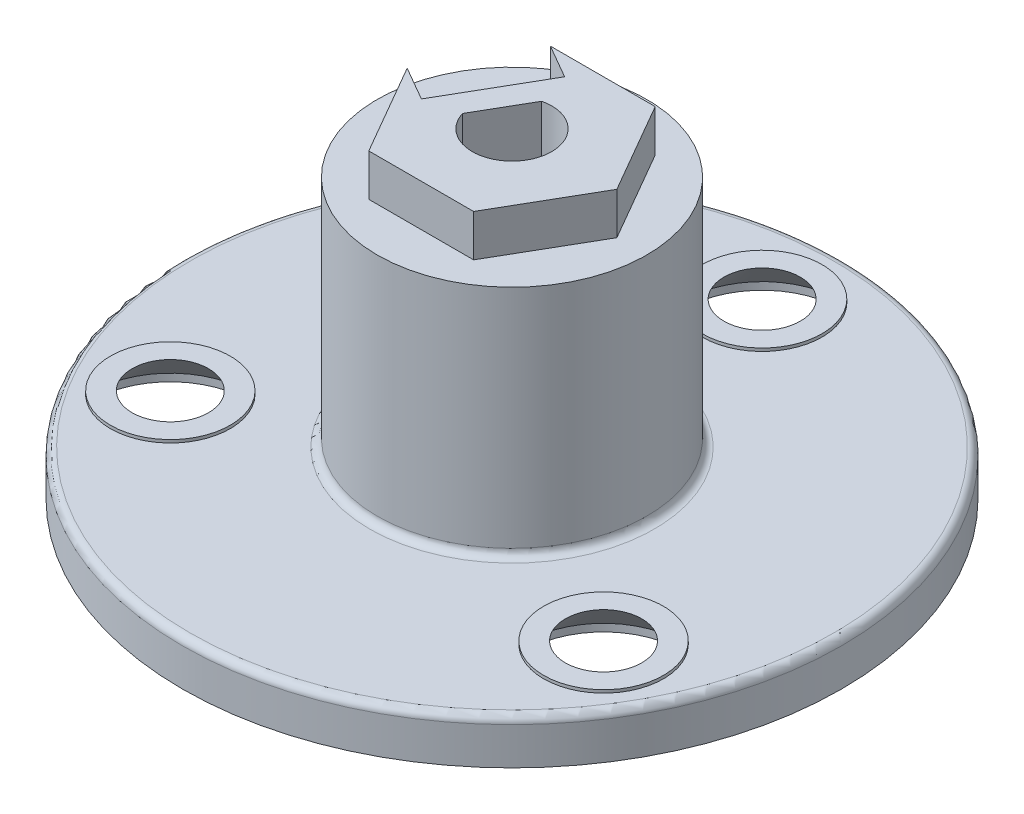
ISO-10303-21;
HEADER;
FILE_DESCRIPTION(('STEP AP214'),'2;1');
FILE_NAME('part.step','',(''),(''),'','','');
FILE_SCHEMA(('AUTOMOTIVE_DESIGN { 1 0 10303 214 1 1 1 1 }'));
ENDSEC;
DATA;
#1=APPLICATION_CONTEXT('core data for automotive mechanical design processes');
#2=APPLICATION_PROTOCOL_DEFINITION('international standard','automotive_design',2000,#1);
#3=PRODUCT_CONTEXT('',#1,'mechanical');
#4=PRODUCT('Part','Part','',(#3));
#5=PRODUCT_RELATED_PRODUCT_CATEGORY('part','',(#4));
#6=PRODUCT_DEFINITION_FORMATION('','',#4);
#7=PRODUCT_DEFINITION_CONTEXT('part definition',#1,'design');
#8=PRODUCT_DEFINITION('design','',#6,#7);
#9=PRODUCT_DEFINITION_SHAPE('','',#8);
#10=(LENGTH_UNIT() NAMED_UNIT(*) SI_UNIT(.MILLI.,.METRE.));
#11=(NAMED_UNIT(*) PLANE_ANGLE_UNIT() SI_UNIT($,.RADIAN.));
#12=(NAMED_UNIT(*) SI_UNIT($,.STERADIAN.) SOLID_ANGLE_UNIT());
#13=UNCERTAINTY_MEASURE_WITH_UNIT(LENGTH_MEASURE(1.E-05),#10,'distance_accuracy_value','');
#14=(GEOMETRIC_REPRESENTATION_CONTEXT(3) GLOBAL_UNCERTAINTY_ASSIGNED_CONTEXT((#13)) GLOBAL_UNIT_ASSIGNED_CONTEXT((#10,
#11,#12)) REPRESENTATION_CONTEXT('',''));
#15=CARTESIAN_POINT('',(0.,0.,0.));
#16=DIRECTION('',(0.,0.,1.));
#17=DIRECTION('',(1.,0.,0.));
#18=AXIS2_PLACEMENT_3D('',#15,#16,#17);
#19=CARTESIAN_POINT('',(0.,3.,0.));
#20=DIRECTION('',(0.,1.,0.));
#21=DIRECTION('',(0.,0.,1.));
#22=AXIS2_PLACEMENT_3D('',#19,#20,#21);
#23=PLANE('',#22);
#24=CARTESIAN_POINT('',(0.,3.,0.));
#25=DIRECTION('',(0.,1.,0.));
#26=DIRECTION('',(0.,0.,1.));
#27=AXIS2_PLACEMENT_3D('',#24,#25,#26);
#28=CIRCLE('',#27,9.5);
#29=CARTESIAN_POINT('',(0.,3.,9.5));
#30=VERTEX_POINT('',#29);
#31=EDGE_CURVE('E48',#30,#30,#28,.F.);
#32=ORIENTED_EDGE('',*,*,#31,.T.);
#33=EDGE_LOOP('',(#32));
#34=FACE_BOUND('',#33,.T.);
#35=CARTESIAN_POINT('',(0.,3.,0.));
#36=DIRECTION('',(0.,1.,0.));
#37=DIRECTION('',(0.,0.,1.));
#38=AXIS2_PLACEMENT_3D('',#35,#36,#37);
#39=CIRCLE('',#38,21.5);
#40=CARTESIAN_POINT('',(0.,3.,21.5));
#41=VERTEX_POINT('',#40);
#42=EDGE_CURVE('E318',#41,#41,#39,.T.);
#43=ORIENTED_EDGE('',*,*,#42,.T.);
#44=EDGE_LOOP('',(#43));
#45=FACE_BOUND('',#44,.T.);
#46=CARTESIAN_POINT('',(-14.4626242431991,3.,8.34999999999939));
#47=DIRECTION('',(0.,1.,0.));
#48=DIRECTION('',(0.,0.,1.));
#49=AXIS2_PLACEMENT_3D('',#46,#47,#48);
#50=CIRCLE('',#49,4.);
#51=CARTESIAN_POINT('',(-14.4626242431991,3.,12.3499999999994));
#52=VERTEX_POINT('',#51);
#53=EDGE_CURVE('E223',#52,#52,#50,.T.);
#54=ORIENTED_EDGE('',*,*,#53,.F.);
#55=EDGE_LOOP('',(#54));
#56=FACE_BOUND('',#55,.T.);
#57=CARTESIAN_POINT('',(1.0696165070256E-12,3.,-16.6999999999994));
#58=DIRECTION('',(0.,1.,0.));
#59=DIRECTION('',(0.,0.,1.));
#60=AXIS2_PLACEMENT_3D('',#57,#58,#59);
#61=CIRCLE('',#60,4.);
#62=CARTESIAN_POINT('',(1.0696165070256E-12,3.,-12.6999999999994));
#63=VERTEX_POINT('',#62);
#64=EDGE_CURVE('E243',#63,#63,#61,.T.);
#65=ORIENTED_EDGE('',*,*,#64,.F.);
#66=EDGE_LOOP('',(#65));
#67=FACE_BOUND('',#66,.T.);
#68=CARTESIAN_POINT('',(14.4626242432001,3.,8.35));
#69=DIRECTION('',(0.,1.,0.));
#70=DIRECTION('',(0.,0.,1.));
#71=AXIS2_PLACEMENT_3D('',#68,#69,#70);
#72=CIRCLE('',#71,4.);
#73=CARTESIAN_POINT('',(14.4626242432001,3.,12.35));
#74=VERTEX_POINT('',#73);
#75=EDGE_CURVE('E237',#74,#74,#72,.T.);
#76=ORIENTED_EDGE('',*,*,#75,.F.);
#77=EDGE_LOOP('',(#76));
#78=FACE_BOUND('',#77,.T.);
#79=ADVANCED_FACE('F39',(#34,#45,#56,#67,#78),#23,.T.);
#80=CARTESIAN_POINT('',(0.,0.,0.));
#81=DIRECTION('',(0.,1.,0.));
#82=DIRECTION('',(0.,0.,1.));
#83=AXIS2_PLACEMENT_3D('',#80,#81,#82);
#84=PLANE('',#83);
#85=CARTESIAN_POINT('',(14.4626242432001,0.,8.35));
#86=DIRECTION('',(0.,-1.,0.));
#87=DIRECTION('',(0.,0.,-1.));
#88=AXIS2_PLACEMENT_3D('',#85,#86,#87);
#89=CIRCLE('',#88,5.25);
#90=CARTESIAN_POINT('',(14.4626242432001,0.,3.1));
#91=VERTEX_POINT('',#90);
#92=EDGE_CURVE('E1025',#91,#91,#89,.T.);
#93=ORIENTED_EDGE('',*,*,#92,.F.);
#94=EDGE_LOOP('',(#93));
#95=FACE_BOUND('',#94,.T.);
#96=CARTESIAN_POINT('',(-14.4626242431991,0.,8.34999999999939));
#97=DIRECTION('',(0.,-1.,0.));
#98=DIRECTION('',(0.,0.,-1.));
#99=AXIS2_PLACEMENT_3D('',#96,#97,#98);
#100=CIRCLE('',#99,5.25);
#101=CARTESIAN_POINT('',(-14.4626242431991,0.,3.09999999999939));
#102=VERTEX_POINT('',#101);
#103=EDGE_CURVE('E313',#102,#102,#100,.T.);
#104=ORIENTED_EDGE('',*,*,#103,.F.);
#105=EDGE_LOOP('',(#104));
#106=FACE_BOUND('',#105,.T.);
#107=CARTESIAN_POINT('',(1.0696165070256E-12,0.,-16.6999999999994));
#108=DIRECTION('',(0.,-1.,0.));
#109=DIRECTION('',(0.,0.,-1.));
#110=AXIS2_PLACEMENT_3D('',#107,#108,#109);
#111=CIRCLE('',#110,5.25);
#112=CARTESIAN_POINT('',(1.0696165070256E-12,0.,-21.9499999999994));
#113=VERTEX_POINT('',#112);
#114=EDGE_CURVE('E307',#113,#113,#111,.T.);
#115=ORIENTED_EDGE('',*,*,#114,.F.);
#116=EDGE_LOOP('',(#115));
#117=FACE_BOUND('',#116,.T.);
#118=CARTESIAN_POINT('',(0.,0.,0.));
#119=DIRECTION('',(0.,1.,0.));
#120=DIRECTION('',(0.,0.,1.));
#121=AXIS2_PLACEMENT_3D('',#118,#119,#120);
#122=CIRCLE('',#121,22.);
#123=CARTESIAN_POINT('',(0.,0.,22.));
#124=VERTEX_POINT('',#123);
#125=EDGE_CURVE('E270',#124,#124,#122,.T.);
#126=ORIENTED_EDGE('',*,*,#125,.F.);
#127=EDGE_LOOP('',(#126));
#128=FACE_BOUND('',#127,.T.);
#129=CARTESIAN_POINT('',(0.,0.,0.));
#130=DIRECTION('',(0.,1.,0.));
#131=DIRECTION('',(0.,0.,1.));
#132=AXIS2_PLACEMENT_3D('',#129,#130,#131);
#133=CIRCLE('',#132,2.65);
#134=CARTESIAN_POINT('',(-2.53623385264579,0.,0.768126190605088));
#135=VERTEX_POINT('',#134);
#136=CARTESIAN_POINT('',(-0.602900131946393,0.,-2.58050604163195));
#137=VERTEX_POINT('',#136);
#138=EDGE_CURVE('E251',#135,#137,#133,.T.);
#139=ORIENTED_EDGE('',*,*,#138,.T.);
#140=DIRECTION('',(-0.500000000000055,0.,0.866025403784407));
#141=VECTOR('',#140,1.);
#142=CARTESIAN_POINT('',(-1.56956699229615,0.,-0.906189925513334));
#143=LINE('',#142,#141);
#144=EDGE_CURVE('E258',#137,#135,#143,.T.);
#145=ORIENTED_EDGE('',*,*,#144,.T.);
#146=EDGE_LOOP('',(#139,#145));
#147=FACE_BOUND('',#146,.T.);
#148=ADVANCED_FACE('F570',(#95,#106,#117,#128,#147),#84,.F.);
#149=CARTESIAN_POINT('',(0.,3.,0.));
#150=DIRECTION('',(0.,-1.,0.));
#151=DIRECTION('',(0.,0.,-1.));
#152=AXIS2_PLACEMENT_3D('',#149,#150,#151);
#153=CYLINDRICAL_SURFACE('',#152,22.);
#154=CARTESIAN_POINT('',(0.,2.5,0.));
#155=DIRECTION('',(0.,1.,0.));
#156=DIRECTION('',(0.,0.,1.));
#157=AXIS2_PLACEMENT_3D('',#154,#155,#156);
#158=CIRCLE('',#157,22.);
#159=CARTESIAN_POINT('',(0.,2.5,22.));
#160=VERTEX_POINT('',#159);
#161=EDGE_CURVE('E11',#160,#160,#158,.F.);
#162=ORIENTED_EDGE('',*,*,#161,.T.);
#163=EDGE_LOOP('',(#162));
#164=FACE_BOUND('',#163,.T.);
#165=ORIENTED_EDGE('',*,*,#125,.T.);
#166=EDGE_LOOP('',(#165));
#167=FACE_BOUND('',#166,.T.);
#168=ADVANCED_FACE('F577',(#164,#167),#153,.T.);
#169=CARTESIAN_POINT('',(0.,3.,0.));
#170=DIRECTION('',(0.,-1.,0.));
#171=DIRECTION('',(0.,0.,-1.));
#172=AXIS2_PLACEMENT_3D('',#169,#170,#171);
#173=CYLINDRICAL_SURFACE('',#172,2.65);
#174=ORIENTED_EDGE('',*,*,#138,.F.);
#175=DIRECTION('',(0.,-1.,0.));
#176=VECTOR('',#175,1.);
#177=CARTESIAN_POINT('',(-2.53623385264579,3.,0.768126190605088));
#178=LINE('',#177,#176);
#179=CARTESIAN_POINT('',(-2.53623385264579,21.4,0.768126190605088));
#180=VERTEX_POINT('',#179);
#181=EDGE_CURVE('E262',#180,#135,#178,.T.);
#182=ORIENTED_EDGE('',*,*,#181,.F.);
#183=CARTESIAN_POINT('',(0.,21.4,0.));
#184=DIRECTION('',(0.,1.,0.));
#185=DIRECTION('',(0.,0.,1.));
#186=AXIS2_PLACEMENT_3D('',#183,#184,#185);
#187=CIRCLE('',#186,2.65);
#188=CARTESIAN_POINT('',(-0.602900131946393,21.4,-2.58050604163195));
#189=VERTEX_POINT('',#188);
#190=EDGE_CURVE('E476',#180,#189,#187,.T.);
#191=ORIENTED_EDGE('',*,*,#190,.T.);
#192=DIRECTION('',(0.,-1.,0.));
#193=VECTOR('',#192,1.);
#194=CARTESIAN_POINT('',(-0.602900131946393,3.,-2.58050604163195));
#195=LINE('',#194,#193);
#196=EDGE_CURVE('E266',#189,#137,#195,.T.);
#197=ORIENTED_EDGE('',*,*,#196,.T.);
#198=EDGE_LOOP('',(#174,#182,#191,#197));
#199=FACE_BOUND('',#198,.T.);
#200=ADVANCED_FACE('F581',(#199),#173,.F.);
#201=CARTESIAN_POINT('',(-1.56956699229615,3.,-0.906189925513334));
#202=DIRECTION('',(0.866025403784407,0.,0.500000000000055));
#203=DIRECTION('',(0.500000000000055,0.,-0.866025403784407));
#204=AXIS2_PLACEMENT_3D('',#201,#202,#203);
#205=PLANE('',#204);
#206=DIRECTION('',(0.500000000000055,0.,-0.866025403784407));
#207=VECTOR('',#206,1.);
#208=CARTESIAN_POINT('',(-1.56956699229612,8.70330482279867,-0.90618992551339));
#209=LINE('',#208,#207);
#210=CARTESIAN_POINT('',(-1.95047907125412,8.70330482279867,-0.24643085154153));
#211=VERTEX_POINT('',#210);
#212=CARTESIAN_POINT('',(-1.18865491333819,8.70330482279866,-1.56594899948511));
#213=VERTEX_POINT('',#212);
#214=EDGE_CURVE('E442',#211,#213,#209,.T.);
#215=ORIENTED_EDGE('',*,*,#214,.F.);
#216=DIRECTION('',(0.250000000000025,-0.866025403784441,-0.433012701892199));
#217=VECTOR('',#216,1.);
#218=CARTESIAN_POINT('',(-0.620449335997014,4.09594666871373,-2.55010992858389));
#219=LINE('',#218,#217);
#220=CARTESIAN_POINT('',(-2.33139115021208,10.0228229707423,0.413328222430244));
#221=VERTEX_POINT('',#220);
#222=EDGE_CURVE('E389',#221,#211,#219,.T.);
#223=ORIENTED_EDGE('',*,*,#222,.F.);
#224=DIRECTION('',(-0.250000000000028,-0.866025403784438,0.433012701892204));
#225=VECTOR('',#224,1.);
#226=CARTESIAN_POINT('',(-3.6614208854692,5.41546481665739,2.71700729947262));
#227=LINE('',#226,#225);
#228=CARTESIAN_POINT('',(-1.95047907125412,11.3423411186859,-0.246430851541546));
#229=VERTEX_POINT('',#228);
#230=EDGE_CURVE('E399',#229,#221,#227,.T.);
#231=ORIENTED_EDGE('',*,*,#230,.F.);
#232=DIRECTION('',(-0.500000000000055,0.,0.866025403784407));
#233=VECTOR('',#232,1.);
#234=CARTESIAN_POINT('',(-1.56956699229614,11.3423411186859,-0.906189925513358));
#235=LINE('',#234,#233);
#236=CARTESIAN_POINT('',(-1.18865491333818,11.3423411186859,-1.56594899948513));
#237=VERTEX_POINT('',#236);
#238=EDGE_CURVE('E410',#237,#229,#235,.T.);
#239=ORIENTED_EDGE('',*,*,#238,.F.);
#240=DIRECTION('',(-0.250000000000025,0.866025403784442,0.433012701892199));
#241=VECTOR('',#240,1.);
#242=CARTESIAN_POINT('',(0.52228690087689,5.41546481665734,-4.52938715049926));
#243=LINE('',#242,#241);
#244=CARTESIAN_POINT('',(-0.807742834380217,10.0228229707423,-2.22570807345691));
#245=VERTEX_POINT('',#244);
#246=EDGE_CURVE('E421',#245,#237,#243,.T.);
#247=ORIENTED_EDGE('',*,*,#246,.F.);
#248=DIRECTION('',(0.250000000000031,0.866025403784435,-0.433012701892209));
#249=VECTOR('',#248,1.);
#250=CARTESIAN_POINT('',(-2.51868464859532,4.0959466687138,0.737730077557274));
#251=LINE('',#250,#249);
#252=EDGE_CURVE('E432',#213,#245,#251,.T.);
#253=ORIENTED_EDGE('',*,*,#252,.F.);
#254=EDGE_LOOP('',(#215,#223,#231,#239,#247,#253));
#255=FACE_BOUND('',#254,.T.);
#256=ORIENTED_EDGE('',*,*,#144,.F.);
#257=ORIENTED_EDGE('',*,*,#196,.F.);
#258=DIRECTION('',(-0.500000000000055,0.,0.866025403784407));
#259=VECTOR('',#258,1.);
#260=CARTESIAN_POINT('',(-2.53623385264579,21.4,0.768126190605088));
#261=LINE('',#260,#259);
#262=EDGE_CURVE('E488',#189,#180,#261,.T.);
#263=ORIENTED_EDGE('',*,*,#262,.T.);
#264=ORIENTED_EDGE('',*,*,#181,.T.);
#265=EDGE_LOOP('',(#256,#257,#263,#264));
#266=FACE_BOUND('',#265,.T.);
#267=ADVANCED_FACE('F589',(#255,#266),#205,.T.);
#268=CARTESIAN_POINT('',(1.0696165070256E-12,3.2,-16.6999999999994));
#269=DIRECTION('',(0.,1.,0.));
#270=DIRECTION('',(0.,0.,1.));
#271=AXIS2_PLACEMENT_3D('',#268,#269,#270);
#272=PLANE('',#271);
#273=CARTESIAN_POINT('',(1.0696165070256E-12,3.2,-16.6999999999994));
#274=DIRECTION('',(0.,1.,0.));
#275=DIRECTION('',(0.,0.,1.));
#276=AXIS2_PLACEMENT_3D('',#273,#274,#275);
#277=CIRCLE('',#276,2.55);
#278=CARTESIAN_POINT('',(1.0696165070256E-12,3.2,-14.1499999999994));
#279=VERTEX_POINT('',#278);
#280=EDGE_CURVE('E217',#279,#279,#277,.T.);
#281=ORIENTED_EDGE('',*,*,#280,.F.);
#282=EDGE_LOOP('',(#281));
#283=FACE_BOUND('',#282,.T.);
#284=CARTESIAN_POINT('',(1.0696165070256E-12,3.2,-16.6999999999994));
#285=DIRECTION('',(0.,1.,0.));
#286=DIRECTION('',(0.,0.,1.));
#287=AXIS2_PLACEMENT_3D('',#284,#285,#286);
#288=CIRCLE('',#287,4.);
#289=CARTESIAN_POINT('',(1.0696165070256E-12,3.2,-12.6999999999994));
#290=VERTEX_POINT('',#289);
#291=EDGE_CURVE('E247',#290,#290,#288,.T.);
#292=ORIENTED_EDGE('',*,*,#291,.T.);
#293=EDGE_LOOP('',(#292));
#294=FACE_BOUND('',#293,.T.);
#295=ADVANCED_FACE('F631',(#283,#294),#272,.T.);
#296=CARTESIAN_POINT('',(1.0696165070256E-12,3.2,-16.6999999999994));
#297=DIRECTION('',(0.,-1.,0.));
#298=DIRECTION('',(0.,0.,-1.));
#299=AXIS2_PLACEMENT_3D('',#296,#297,#298);
#300=CYLINDRICAL_SURFACE('',#299,4.);
#301=ORIENTED_EDGE('',*,*,#291,.F.);
#302=EDGE_LOOP('',(#301));
#303=FACE_BOUND('',#302,.T.);
#304=ORIENTED_EDGE('',*,*,#64,.T.);
#305=EDGE_LOOP('',(#304));
#306=FACE_BOUND('',#305,.T.);
#307=ADVANCED_FACE('F626',(#303,#306),#300,.T.);
#308=CARTESIAN_POINT('',(14.4626242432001,3.2,8.35));
#309=DIRECTION('',(0.,1.,0.));
#310=DIRECTION('',(0.,0.,1.));
#311=AXIS2_PLACEMENT_3D('',#308,#309,#310);
#312=PLANE('',#311);
#313=CARTESIAN_POINT('',(14.4626242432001,3.2,8.35));
#314=DIRECTION('',(0.,1.,0.));
#315=DIRECTION('',(0.,0.,1.));
#316=AXIS2_PLACEMENT_3D('',#313,#314,#315);
#317=CIRCLE('',#316,2.55);
#318=CARTESIAN_POINT('',(14.4626242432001,3.2,10.9));
#319=VERTEX_POINT('',#318);
#320=EDGE_CURVE('E309',#319,#319,#317,.T.);
#321=ORIENTED_EDGE('',*,*,#320,.F.);
#322=EDGE_LOOP('',(#321));
#323=FACE_BOUND('',#322,.T.);
#324=CARTESIAN_POINT('',(14.4626242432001,3.2,8.35));
#325=DIRECTION('',(0.,1.,0.));
#326=DIRECTION('',(0.,0.,1.));
#327=AXIS2_PLACEMENT_3D('',#324,#325,#326);
#328=CIRCLE('',#327,4.);
#329=CARTESIAN_POINT('',(14.4626242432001,3.2,12.35));
#330=VERTEX_POINT('',#329);
#331=EDGE_CURVE('E239',#330,#330,#328,.T.);
#332=ORIENTED_EDGE('',*,*,#331,.T.);
#333=EDGE_LOOP('',(#332));
#334=FACE_BOUND('',#333,.T.);
#335=ADVANCED_FACE('F623',(#323,#334),#312,.T.);
#336=CARTESIAN_POINT('',(14.4626242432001,3.2,8.35));
#337=DIRECTION('',(0.,-1.,0.));
#338=DIRECTION('',(0.,0.,-1.));
#339=AXIS2_PLACEMENT_3D('',#336,#337,#338);
#340=CYLINDRICAL_SURFACE('',#339,4.);
#341=ORIENTED_EDGE('',*,*,#331,.F.);
#342=EDGE_LOOP('',(#341));
#343=FACE_BOUND('',#342,.T.);
#344=ORIENTED_EDGE('',*,*,#75,.T.);
#345=EDGE_LOOP('',(#344));
#346=FACE_BOUND('',#345,.T.);
#347=ADVANCED_FACE('F619',(#343,#346),#340,.T.);
#348=CARTESIAN_POINT('',(-14.4626242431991,3.2,8.34999999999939));
#349=DIRECTION('',(0.,1.,0.));
#350=DIRECTION('',(0.,0.,1.));
#351=AXIS2_PLACEMENT_3D('',#348,#349,#350);
#352=PLANE('',#351);
#353=CARTESIAN_POINT('',(-14.4626242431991,3.2,8.34999999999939));
#354=DIRECTION('',(0.,1.,0.));
#355=DIRECTION('',(0.,0.,1.));
#356=AXIS2_PLACEMENT_3D('',#353,#354,#355);
#357=CIRCLE('',#356,2.55);
#358=CARTESIAN_POINT('',(-14.4626242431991,3.2,10.8999999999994));
#359=VERTEX_POINT('',#358);
#360=EDGE_CURVE('E303',#359,#359,#357,.T.);
#361=ORIENTED_EDGE('',*,*,#360,.F.);
#362=EDGE_LOOP('',(#361));
#363=FACE_BOUND('',#362,.T.);
#364=CARTESIAN_POINT('',(-14.4626242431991,3.2,8.34999999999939));
#365=DIRECTION('',(0.,1.,0.));
#366=DIRECTION('',(0.,0.,1.));
#367=AXIS2_PLACEMENT_3D('',#364,#365,#366);
#368=CIRCLE('',#367,4.);
#369=CARTESIAN_POINT('',(-14.4626242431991,3.2,12.3499999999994));
#370=VERTEX_POINT('',#369);
#371=EDGE_CURVE('E229',#370,#370,#368,.T.);
#372=ORIENTED_EDGE('',*,*,#371,.T.);
#373=EDGE_LOOP('',(#372));
#374=FACE_BOUND('',#373,.T.);
#375=ADVANCED_FACE('F616',(#363,#374),#352,.T.);
#376=CARTESIAN_POINT('',(-14.4626242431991,3.2,8.34999999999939));
#377=DIRECTION('',(0.,-1.,0.));
#378=DIRECTION('',(0.,0.,-1.));
#379=AXIS2_PLACEMENT_3D('',#376,#377,#378);
#380=CYLINDRICAL_SURFACE('',#379,4.);
#381=ORIENTED_EDGE('',*,*,#371,.F.);
#382=EDGE_LOOP('',(#381));
#383=FACE_BOUND('',#382,.T.);
#384=ORIENTED_EDGE('',*,*,#53,.T.);
#385=EDGE_LOOP('',(#384));
#386=FACE_BOUND('',#385,.T.);
#387=ADVANCED_FACE('F337',(#383,#386),#380,.T.);
#388=CARTESIAN_POINT('',(0.,18.4,0.));
#389=DIRECTION('',(0.,-1.,0.));
#390=DIRECTION('',(0.,0.,-1.));
#391=AXIS2_PLACEMENT_3D('',#388,#389,#390);
#392=CYLINDRICAL_SURFACE('',#391,9.);
#393=CARTESIAN_POINT('',(0.,3.5,0.));
#394=DIRECTION('',(0.,1.,0.));
#395=DIRECTION('',(0.,0.,1.));
#396=AXIS2_PLACEMENT_3D('',#393,#394,#395);
#397=CIRCLE('',#396,9.);
#398=CARTESIAN_POINT('',(0.,3.5,9.));
#399=VERTEX_POINT('',#398);
#400=EDGE_CURVE('E298',#399,#399,#397,.T.);
#401=ORIENTED_EDGE('',*,*,#400,.T.);
#402=EDGE_LOOP('',(#401));
#403=FACE_BOUND('',#402,.T.);
#404=CARTESIAN_POINT('',(0.,7.38378667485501,0.));
#405=DIRECTION('',(-0.43301270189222,-0.499999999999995,0.750000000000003));
#406=DIRECTION('',(0.249999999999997,-0.866025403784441,-0.433012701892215));
#407=AXIS2_PLACEMENT_3D('',#404,#405,#406);
#408=ELLIPSE('',#407,18.0000000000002,9.);
#409=CARTESIAN_POINT('',(-8.44354739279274,10.0228229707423,-3.11552682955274));
#410=VERTEX_POINT('',#409);
#411=CARTESIAN_POINT('',(-8.14716715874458,8.70330482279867,-3.82409038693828));
#412=VERTEX_POINT('',#411);
#413=EDGE_CURVE('E343',#410,#412,#408,.T.);
#414=ORIENTED_EDGE('',*,*,#413,.T.);
#415=CARTESIAN_POINT('',(0.,8.70330482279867,0.));
#416=DIRECTION('',(0.,-1.,0.));
#417=DIRECTION('',(0.,0.,-1.));
#418=AXIS2_PLACEMENT_3D('',#415,#416,#417);
#419=CIRCLE('',#418,9.);
#420=CARTESIAN_POINT('',(-7.38534300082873,8.70330482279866,-5.14360853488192));
#421=VERTEX_POINT('',#420);
#422=EDGE_CURVE('E439',#412,#421,#419,.T.);
#423=ORIENTED_EDGE('',*,*,#422,.T.);
#424=CARTESIAN_POINT('',(0.,7.38378667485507,0.));
#425=DIRECTION('',(0.433012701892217,-0.500000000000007,-0.749999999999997));
#426=DIRECTION('',(-0.250000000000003,-0.866025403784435,0.433012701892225));
#427=AXIS2_PLACEMENT_3D('',#424,#425,#426);
#428=ELLIPSE('',#427,17.9999999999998,9.);
#429=CARTESIAN_POINT('',(-6.91989907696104,10.0228229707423,-5.75456312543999));
#430=VERTEX_POINT('',#429);
#431=EDGE_CURVE('E428',#421,#430,#428,.T.);
#432=ORIENTED_EDGE('',*,*,#431,.T.);
#433=CARTESIAN_POINT('',(0.,12.6618592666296,0.));
#434=DIRECTION('',(0.43301270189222,0.499999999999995,-0.750000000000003));
#435=DIRECTION('',(0.249999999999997,-0.866025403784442,-0.433012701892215));
#436=AXIS2_PLACEMENT_3D('',#433,#434,#435);
#437=ELLIPSE('',#436,18.0000000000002,9.);
#438=CARTESIAN_POINT('',(-7.38534300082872,11.3423411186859,-5.14360853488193));
#439=VERTEX_POINT('',#438);
#440=EDGE_CURVE('E417',#430,#439,#437,.T.);
#441=ORIENTED_EDGE('',*,*,#440,.T.);
#442=CARTESIAN_POINT('',(0.,11.3423411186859,0.));
#443=DIRECTION('',(0.,1.,0.));
#444=DIRECTION('',(0.,0.,1.));
#445=AXIS2_PLACEMENT_3D('',#442,#443,#444);
#446=CIRCLE('',#445,9.);
#447=CARTESIAN_POINT('',(-8.14716715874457,11.3423411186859,-3.8240903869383));
#448=VERTEX_POINT('',#447);
#449=EDGE_CURVE('E406',#439,#448,#446,.T.);
#450=ORIENTED_EDGE('',*,*,#449,.T.);
#451=CARTESIAN_POINT('',(0.,12.6618592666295,0.));
#452=DIRECTION('',(-0.433012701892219,0.500000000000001,0.75));
#453=DIRECTION('',(-0.25,-0.866025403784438,0.43301270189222));
#454=AXIS2_PLACEMENT_3D('',#451,#452,#453);
#455=ELLIPSE('',#454,18.,9.);
#456=EDGE_CURVE('E396',#448,#410,#455,.T.);
#457=ORIENTED_EDGE('',*,*,#456,.T.);
#458=EDGE_LOOP('',(#414,#423,#432,#441,#450,#457));
#459=FACE_BOUND('',#458,.T.);
#460=CARTESIAN_POINT('',(0.,18.6,0.));
#461=DIRECTION('',(0.,1.,0.));
#462=DIRECTION('',(0.,0.,1.));
#463=AXIS2_PLACEMENT_3D('',#460,#461,#462);
#464=CIRCLE('',#463,9.);
#465=CARTESIAN_POINT('',(0.,18.6,9.));
#466=VERTEX_POINT('',#465);
#467=EDGE_CURVE('E346',#466,#466,#464,.T.);
#468=ORIENTED_EDGE('',*,*,#467,.F.);
#469=EDGE_LOOP('',(#468));
#470=FACE_BOUND('',#469,.T.);
#471=ADVANCED_FACE('F333',(#403,#459,#470),#392,.T.);
#472=CARTESIAN_POINT('',(0.,21.4,0.));
#473=DIRECTION('',(0.,1.,0.));
#474=DIRECTION('',(0.,0.,1.));
#475=AXIS2_PLACEMENT_3D('',#472,#473,#474);
#476=PLANE('',#475);
#477=DIRECTION('',(0.866025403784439,0.,0.5));
#478=VECTOR('',#477,1.);
#479=CARTESIAN_POINT('',(-4.74833395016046,21.4,1.3));
#480=LINE('',#479,#478);
#481=CARTESIAN_POINT('',(-7.,21.4,0.));
#482=VERTEX_POINT('',#481);
#483=CARTESIAN_POINT('',(-4.74833395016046,21.4,1.3));
#484=VERTEX_POINT('',#483);
#485=EDGE_CURVE('E445',#482,#484,#480,.T.);
#486=ORIENTED_EDGE('',*,*,#485,.F.);
#487=DIRECTION('',(0.5,0.,0.866025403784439));
#488=VECTOR('',#487,1.);
#489=CARTESIAN_POINT('',(-7.,21.4,0.));
#490=LINE('',#489,#488);
#491=CARTESIAN_POINT('',(-3.5,21.4,6.06217782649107));
#492=VERTEX_POINT('',#491);
#493=EDGE_CURVE('E501',#482,#492,#490,.T.);
#494=ORIENTED_EDGE('',*,*,#493,.T.);
#495=DIRECTION('',(1.,0.,0.));
#496=VECTOR('',#495,1.);
#497=CARTESIAN_POINT('',(-3.5,21.4,6.06217782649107));
#498=LINE('',#497,#496);
#499=CARTESIAN_POINT('',(3.5,21.4,6.06217782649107));
#500=VERTEX_POINT('',#499);
#501=EDGE_CURVE('E504',#492,#500,#498,.T.);
#502=ORIENTED_EDGE('',*,*,#501,.T.);
#503=DIRECTION('',(0.5,0.,-0.866025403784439));
#504=VECTOR('',#503,1.);
#505=CARTESIAN_POINT('',(3.5,21.4,6.06217782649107));
#506=LINE('',#505,#504);
#507=CARTESIAN_POINT('',(7.,21.4,0.));
#508=VERTEX_POINT('',#507);
#509=EDGE_CURVE('E492',#500,#508,#506,.T.);
#510=ORIENTED_EDGE('',*,*,#509,.T.);
#511=DIRECTION('',(-0.5,0.,-0.866025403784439));
#512=VECTOR('',#511,1.);
#513=CARTESIAN_POINT('',(7.,21.4,0.));
#514=LINE('',#513,#512);
#515=CARTESIAN_POINT('',(3.5,21.4,-6.06217782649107));
#516=VERTEX_POINT('',#515);
#517=EDGE_CURVE('E220',#508,#516,#514,.T.);
#518=ORIENTED_EDGE('',*,*,#517,.T.);
#519=DIRECTION('',(-1.,0.,0.));
#520=VECTOR('',#519,1.);
#521=CARTESIAN_POINT('',(3.5,21.4,-6.06217782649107));
#522=LINE('',#521,#520);
#523=CARTESIAN_POINT('',(-3.5,21.4,-6.06217782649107));
#524=VERTEX_POINT('',#523);
#525=EDGE_CURVE('E497',#516,#524,#522,.T.);
#526=ORIENTED_EDGE('',*,*,#525,.T.);
#527=DIRECTION('',(-0.866025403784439,0.,-0.5));
#528=VECTOR('',#527,1.);
#529=CARTESIAN_POINT('',(-3.5,21.4,-6.06217782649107));
#530=LINE('',#529,#528);
#531=CARTESIAN_POINT('',(-1.24833395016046,21.4,-4.76217782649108));
#532=VERTEX_POINT('',#531);
#533=EDGE_CURVE('E451',#532,#524,#530,.T.);
#534=ORIENTED_EDGE('',*,*,#533,.F.);
#535=DIRECTION('',(0.5,0.,-0.866025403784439));
#536=VECTOR('',#535,1.);
#537=CARTESIAN_POINT('',(-1.24833395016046,21.4,-4.76217782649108));
#538=LINE('',#537,#536);
#539=EDGE_CURVE('E467',#484,#532,#538,.T.);
#540=ORIENTED_EDGE('',*,*,#539,.F.);
#541=EDGE_LOOP('',(#486,#494,#502,#510,#518,#526,#534,#540));
#542=FACE_BOUND('',#541,.T.);
#543=ORIENTED_EDGE('',*,*,#262,.F.);
#544=ORIENTED_EDGE('',*,*,#190,.F.);
#545=EDGE_LOOP('',(#543,#544));
#546=FACE_BOUND('',#545,.T.);
#547=ADVANCED_FACE('F336',(#542,#546),#476,.T.);
#548=CARTESIAN_POINT('',(3.5,21.4,6.06217782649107));
#549=DIRECTION('',(-0.866025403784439,0.,-0.5));
#550=DIRECTION('',(-0.5,0.,0.866025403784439));
#551=AXIS2_PLACEMENT_3D('',#548,#549,#550);
#552=PLANE('',#551);
#553=DIRECTION('',(0.,-1.,0.));
#554=VECTOR('',#553,1.);
#555=CARTESIAN_POINT('',(3.5,21.4,6.06217782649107));
#556=LINE('',#555,#554);
#557=CARTESIAN_POINT('',(3.50000000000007,18.6,6.06217782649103));
#558=VERTEX_POINT('',#557);
#559=EDGE_CURVE('E215',#500,#558,#556,.T.);
#560=ORIENTED_EDGE('',*,*,#559,.T.);
#561=DIRECTION('',(0.499999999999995,0.,-0.866025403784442));
#562=VECTOR('',#561,1.);
#563=CARTESIAN_POINT('',(3.50000000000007,18.6,6.06217782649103));
#564=LINE('',#563,#562);
#565=CARTESIAN_POINT('',(7.,18.6,0.));
#566=VERTEX_POINT('',#565);
#567=EDGE_CURVE('E197',#558,#566,#564,.T.);
#568=ORIENTED_EDGE('',*,*,#567,.T.);
#569=DIRECTION('',(0.,-1.,0.));
#570=VECTOR('',#569,1.);
#571=CARTESIAN_POINT('',(7.,21.4,0.));
#572=LINE('',#571,#570);
#573=EDGE_CURVE('E213',#508,#566,#572,.T.);
#574=ORIENTED_EDGE('',*,*,#573,.F.);
#575=ORIENTED_EDGE('',*,*,#509,.F.);
#576=EDGE_LOOP('',(#560,#568,#574,#575));
#577=FACE_BOUND('',#576,.T.);
#578=ADVANCED_FACE('F211',(#577),#552,.F.);
#579=CARTESIAN_POINT('',(7.,21.4,0.));
#580=DIRECTION('',(-0.866025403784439,0.,0.5));
#581=DIRECTION('',(0.5,0.,0.866025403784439));
#582=AXIS2_PLACEMENT_3D('',#579,#580,#581);
#583=PLANE('',#582);
#584=ORIENTED_EDGE('',*,*,#573,.T.);
#585=DIRECTION('',(-0.500000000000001,0.,-0.866025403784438));
#586=VECTOR('',#585,1.);
#587=CARTESIAN_POINT('',(7.,18.6,0.));
#588=LINE('',#587,#586);
#589=CARTESIAN_POINT('',(3.49999999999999,18.6,-6.06217782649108));
#590=VERTEX_POINT('',#589);
#591=EDGE_CURVE('E194',#566,#590,#588,.T.);
#592=ORIENTED_EDGE('',*,*,#591,.T.);
#593=DIRECTION('',(0.,-1.,0.));
#594=VECTOR('',#593,1.);
#595=CARTESIAN_POINT('',(3.5,21.4,-6.06217782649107));
#596=LINE('',#595,#594);
#597=EDGE_CURVE('E224',#516,#590,#596,.T.);
#598=ORIENTED_EDGE('',*,*,#597,.F.);
#599=ORIENTED_EDGE('',*,*,#517,.F.);
#600=EDGE_LOOP('',(#584,#592,#598,#599));
#601=FACE_BOUND('',#600,.T.);
#602=ADVANCED_FACE('F219',(#601),#583,.F.);
#603=CARTESIAN_POINT('',(3.5,21.4,-6.06217782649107));
#604=DIRECTION('',(0.,0.,1.));
#605=DIRECTION('',(1.,0.,0.));
#606=AXIS2_PLACEMENT_3D('',#603,#604,#605);
#607=PLANE('',#606);
#608=ORIENTED_EDGE('',*,*,#597,.T.);
#609=DIRECTION('',(-1.,0.,0.));
#610=VECTOR('',#609,1.);
#611=CARTESIAN_POINT('',(3.49999999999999,18.6,-6.06217782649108));
#612=LINE('',#611,#610);
#613=CARTESIAN_POINT('',(-3.50000000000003,18.6,-6.06217782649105));
#614=VERTEX_POINT('',#613);
#615=EDGE_CURVE('E201',#590,#614,#612,.T.);
#616=ORIENTED_EDGE('',*,*,#615,.T.);
#617=DIRECTION('',(0.,-1.,0.));
#618=VECTOR('',#617,1.);
#619=CARTESIAN_POINT('',(-3.5,21.4,-6.06217782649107));
#620=LINE('',#619,#618);
#621=EDGE_CURVE('E231',#524,#614,#620,.T.);
#622=ORIENTED_EDGE('',*,*,#621,.F.);
#623=ORIENTED_EDGE('',*,*,#525,.F.);
#624=EDGE_LOOP('',(#608,#616,#622,#623));
#625=FACE_BOUND('',#624,.T.);
#626=ADVANCED_FACE('F525',(#625),#607,.F.);
#627=CARTESIAN_POINT('',(-7.,21.4,0.));
#628=DIRECTION('',(0.866025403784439,0.,-0.5));
#629=DIRECTION('',(-0.5,0.,-0.866025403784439));
#630=AXIS2_PLACEMENT_3D('',#627,#628,#629);
#631=PLANE('',#630);
#632=DIRECTION('',(0.,-1.,0.));
#633=VECTOR('',#632,1.);
#634=CARTESIAN_POINT('',(-7.,21.4,0.));
#635=LINE('',#634,#633);
#636=CARTESIAN_POINT('',(-7.,18.6,0.));
#637=VERTEX_POINT('',#636);
#638=EDGE_CURVE('E513',#482,#637,#635,.T.);
#639=ORIENTED_EDGE('',*,*,#638,.T.);
#640=DIRECTION('',(0.500000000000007,0.,0.866025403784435));
#641=VECTOR('',#640,1.);
#642=CARTESIAN_POINT('',(-7.,18.6,0.));
#643=LINE('',#642,#641);
#644=CARTESIAN_POINT('',(-3.49999999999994,18.6,6.0621778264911));
#645=VERTEX_POINT('',#644);
#646=EDGE_CURVE('E355',#637,#645,#643,.T.);
#647=ORIENTED_EDGE('',*,*,#646,.T.);
#648=DIRECTION('',(0.,-1.,0.));
#649=VECTOR('',#648,1.);
#650=CARTESIAN_POINT('',(-3.5,21.4,6.06217782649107));
#651=LINE('',#650,#649);
#652=EDGE_CURVE('E509',#492,#645,#651,.T.);
#653=ORIENTED_EDGE('',*,*,#652,.F.);
#654=ORIENTED_EDGE('',*,*,#493,.F.);
#655=EDGE_LOOP('',(#639,#647,#653,#654));
#656=FACE_BOUND('',#655,.T.);
#657=ADVANCED_FACE('F537',(#656),#631,.F.);
#658=CARTESIAN_POINT('',(-3.5,21.4,6.06217782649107));
#659=DIRECTION('',(0.,0.,-1.));
#660=DIRECTION('',(-1.,0.,0.));
#661=AXIS2_PLACEMENT_3D('',#658,#659,#660);
#662=PLANE('',#661);
#663=ORIENTED_EDGE('',*,*,#652,.T.);
#664=DIRECTION('',(1.,0.,0.));
#665=VECTOR('',#664,1.);
#666=CARTESIAN_POINT('',(-3.49999999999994,18.6,6.0621778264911));
#667=LINE('',#666,#665);
#668=EDGE_CURVE('E349',#645,#558,#667,.T.);
#669=ORIENTED_EDGE('',*,*,#668,.T.);
#670=ORIENTED_EDGE('',*,*,#559,.F.);
#671=ORIENTED_EDGE('',*,*,#501,.F.);
#672=EDGE_LOOP('',(#663,#669,#670,#671));
#673=FACE_BOUND('',#672,.T.);
#674=ADVANCED_FACE('F541',(#673),#662,.F.);
#675=CARTESIAN_POINT('',(-4.74833395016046,6.4,1.3));
#676=DIRECTION('',(-0.5,0.,0.866025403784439));
#677=DIRECTION('',(0.866025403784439,0.,0.5));
#678=AXIS2_PLACEMENT_3D('',#675,#676,#677);
#679=PLANE('',#678);
#680=ORIENTED_EDGE('',*,*,#485,.T.);
#681=DIRECTION('',(0.,1.,0.));
#682=VECTOR('',#681,1.);
#683=CARTESIAN_POINT('',(-4.74833395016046,6.4,1.3));
#684=LINE('',#683,#682);
#685=CARTESIAN_POINT('',(-4.74833395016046,6.4,1.3));
#686=VERTEX_POINT('',#685);
#687=EDGE_CURVE('E463',#686,#484,#684,.T.);
#688=ORIENTED_EDGE('',*,*,#687,.F.);
#689=DIRECTION('',(0.866025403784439,0.,0.5));
#690=VECTOR('',#689,1.);
#691=CARTESIAN_POINT('',(-4.74833395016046,6.4,1.3));
#692=LINE('',#691,#690);
#693=CARTESIAN_POINT('',(-7.,6.4,0.));
#694=VERTEX_POINT('',#693);
#695=EDGE_CURVE('E446',#694,#686,#692,.T.);
#696=ORIENTED_EDGE('',*,*,#695,.F.);
#697=DIRECTION('',(0.,1.,0.));
#698=VECTOR('',#697,1.);
#699=CARTESIAN_POINT('',(-7.,6.4,0.));
#700=LINE('',#699,#698);
#701=EDGE_CURVE('E473',#694,#637,#700,.T.);
#702=ORIENTED_EDGE('',*,*,#701,.T.);
#703=ORIENTED_EDGE('',*,*,#638,.F.);
#704=EDGE_LOOP('',(#680,#688,#696,#702,#703));
#705=FACE_BOUND('',#704,.T.);
#706=ADVANCED_FACE('F547',(#705),#679,.F.);
#707=CARTESIAN_POINT('',(-7.,6.4,0.));
#708=DIRECTION('',(-0.866025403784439,0.,-0.5));
#709=DIRECTION('',(-0.5,0.,0.866025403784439));
#710=AXIS2_PLACEMENT_3D('',#707,#708,#709);
#711=PLANE('',#710);
#712=DIRECTION('',(-0.250000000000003,-0.866025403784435,0.433012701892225));
#713=VECTOR('',#712,1.);
#714=CARTESIAN_POINT('',(-5.9004960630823,5.13040221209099,-1.90439668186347));
#715=LINE('',#714,#713);
#716=CARTESIAN_POINT('',(-4.48817584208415,10.0228229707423,-4.35060706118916));
#717=VERTEX_POINT('',#716);
#718=CARTESIAN_POINT('',(-4.86908792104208,8.70330482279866,-3.69084798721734));
#719=VERTEX_POINT('',#718);
#720=EDGE_CURVE('E424',#717,#719,#715,.T.);
#721=ORIENTED_EDGE('',*,*,#720,.T.);
#722=DIRECTION('',(-0.5,0.,0.866025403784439));
#723=VECTOR('',#722,1.);
#724=CARTESIAN_POINT('',(-6.99999999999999,8.70330482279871,0.));
#725=LINE('',#724,#723);
#726=CARTESIAN_POINT('',(-5.63091207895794,8.70330482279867,-2.37132983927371));
#727=VERTEX_POINT('',#726);
#728=EDGE_CURVE('E435',#719,#727,#725,.T.);
#729=ORIENTED_EDGE('',*,*,#728,.T.);
#730=DIRECTION('',(-0.249999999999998,0.866025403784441,0.433012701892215));
#731=VECTOR('',#730,1.);
#732=CARTESIAN_POINT('',(-5.47450393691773,8.1614911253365,-2.64223668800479));
#733=LINE('',#732,#731);
#734=CARTESIAN_POINT('',(-6.01182415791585,10.0228229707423,-1.71157076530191));
#735=VERTEX_POINT('',#734);
#736=EDGE_CURVE('E383',#727,#735,#733,.T.);
#737=ORIENTED_EDGE('',*,*,#736,.T.);
#738=DIRECTION('',(0.25,0.866025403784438,-0.43301270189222));
#739=VECTOR('',#738,1.);
#740=CARTESIAN_POINT('',(-7.04323229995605,6.44992036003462,0.0748805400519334));
#741=LINE('',#740,#739);
#742=CARTESIAN_POINT('',(-5.63091207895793,11.3423411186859,-2.37132983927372));
#743=VERTEX_POINT('',#742);
#744=EDGE_CURVE('E392',#735,#743,#741,.T.);
#745=ORIENTED_EDGE('',*,*,#744,.T.);
#746=DIRECTION('',(0.5,0.,-0.866025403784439));
#747=VECTOR('',#746,1.);
#748=CARTESIAN_POINT('',(-6.99999999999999,11.3423411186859,0.));
#749=LINE('',#748,#747);
#750=CARTESIAN_POINT('',(-4.86908792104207,11.3423411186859,-3.69084798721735));
#751=VERTEX_POINT('',#750);
#752=EDGE_CURVE('E402',#743,#751,#749,.T.);
#753=ORIENTED_EDGE('',*,*,#752,.T.);
#754=DIRECTION('',(0.249999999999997,-0.866025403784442,-0.433012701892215));
#755=VECTOR('',#754,1.);
#756=CARTESIAN_POINT('',(-4.33176770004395,9.48100927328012,-4.62151390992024));
#757=LINE('',#756,#755);
#758=EDGE_CURVE('E413',#751,#717,#757,.T.);
#759=ORIENTED_EDGE('',*,*,#758,.T.);
#760=EDGE_LOOP('',(#721,#729,#737,#745,#753,#759));
#761=FACE_BOUND('',#760,.T.);
#762=DIRECTION('',(0.,1.,0.));
#763=VECTOR('',#762,1.);
#764=CARTESIAN_POINT('',(-3.5,6.4,-6.06217782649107));
#765=LINE('',#764,#763);
#766=CARTESIAN_POINT('',(-3.5,6.4,-6.06217782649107));
#767=VERTEX_POINT('',#766);
#768=EDGE_CURVE('E477',#767,#614,#765,.T.);
#769=ORIENTED_EDGE('',*,*,#768,.T.);
#770=DIRECTION('',(-0.499999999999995,0.,0.866025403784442));
#771=VECTOR('',#770,1.);
#772=CARTESIAN_POINT('',(-3.50000000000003,18.6,-6.06217782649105));
#773=LINE('',#772,#771);
#774=EDGE_CURVE('E527',#614,#637,#773,.T.);
#775=ORIENTED_EDGE('',*,*,#774,.T.);
#776=ORIENTED_EDGE('',*,*,#701,.F.);
#777=DIRECTION('',(-0.5,0.,0.866025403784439));
#778=VECTOR('',#777,1.);
#779=CARTESIAN_POINT('',(-7.,6.4,0.));
#780=LINE('',#779,#778);
#781=EDGE_CURVE('E459',#767,#694,#780,.T.);
#782=ORIENTED_EDGE('',*,*,#781,.F.);
#783=EDGE_LOOP('',(#769,#775,#776,#782));
#784=FACE_BOUND('',#783,.T.);
#785=ADVANCED_FACE('F552',(#761,#784),#711,.F.);
#786=CARTESIAN_POINT('',(-3.5,6.4,-6.06217782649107));
#787=DIRECTION('',(0.5,0.,-0.866025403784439));
#788=DIRECTION('',(-0.866025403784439,0.,-0.5));
#789=AXIS2_PLACEMENT_3D('',#786,#787,#788);
#790=PLANE('',#789);
#791=ORIENTED_EDGE('',*,*,#533,.T.);
#792=ORIENTED_EDGE('',*,*,#621,.T.);
#793=ORIENTED_EDGE('',*,*,#768,.F.);
#794=DIRECTION('',(-0.866025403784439,0.,-0.5));
#795=VECTOR('',#794,1.);
#796=CARTESIAN_POINT('',(-3.5,6.4,-6.06217782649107));
#797=LINE('',#796,#795);
#798=CARTESIAN_POINT('',(-1.24833395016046,6.4,-4.76217782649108));
#799=VERTEX_POINT('',#798);
#800=EDGE_CURVE('E455',#799,#767,#797,.T.);
#801=ORIENTED_EDGE('',*,*,#800,.F.);
#802=DIRECTION('',(0.,1.,0.));
#803=VECTOR('',#802,1.);
#804=CARTESIAN_POINT('',(-1.24833395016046,6.4,-4.76217782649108));
#805=LINE('',#804,#803);
#806=EDGE_CURVE('E480',#799,#532,#805,.T.);
#807=ORIENTED_EDGE('',*,*,#806,.T.);
#808=EDGE_LOOP('',(#791,#792,#793,#801,#807));
#809=FACE_BOUND('',#808,.T.);
#810=ADVANCED_FACE('F520',(#809),#790,.F.);
#811=CARTESIAN_POINT('',(-1.24833395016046,6.4,-4.76217782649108));
#812=DIRECTION('',(0.866025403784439,0.,0.5));
#813=DIRECTION('',(0.5,0.,-0.866025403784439));
#814=AXIS2_PLACEMENT_3D('',#811,#812,#813);
#815=PLANE('',#814);
#816=DIRECTION('',(0.249999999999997,-0.866025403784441,-0.433012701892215));
#817=VECTOR('',#816,1.);
#818=CARTESIAN_POINT('',(-2.34783788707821,5.13040221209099,-2.85778114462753));
#819=LINE('',#818,#817);
#820=CARTESIAN_POINT('',(-3.76015810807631,10.0228229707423,-0.411570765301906));
#821=VERTEX_POINT('',#820);
#822=CARTESIAN_POINT('',(-3.37924602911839,8.70330482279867,-1.07132983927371));
#823=VERTEX_POINT('',#822);
#824=EDGE_CURVE('E274',#821,#823,#819,.T.);
#825=ORIENTED_EDGE('',*,*,#824,.T.);
#826=DIRECTION('',(0.5,0.,-0.866025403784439));
#827=VECTOR('',#826,1.);
#828=CARTESIAN_POINT('',(-1.24833395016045,8.70330482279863,-4.7621778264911));
#829=LINE('',#828,#827);
#830=CARTESIAN_POINT('',(-2.61742187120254,8.70330482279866,-2.39084798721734));
#831=VERTEX_POINT('',#830);
#832=EDGE_CURVE('E294',#823,#831,#829,.T.);
#833=ORIENTED_EDGE('',*,*,#832,.T.);
#834=DIRECTION('',(0.250000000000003,0.866025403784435,-0.433012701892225));
#835=VECTOR('',#834,1.);
#836=CARTESIAN_POINT('',(-2.77383001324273,8.16149112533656,-2.11994113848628));
#837=LINE('',#836,#835);
#838=CARTESIAN_POINT('',(-2.23650979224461,10.0228229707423,-3.05060706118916));
#839=VERTEX_POINT('',#838);
#840=EDGE_CURVE('E290',#831,#839,#837,.T.);
#841=ORIENTED_EDGE('',*,*,#840,.T.);
#842=DIRECTION('',(-0.249999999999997,0.866025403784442,0.433012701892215));
#843=VECTOR('',#842,1.);
#844=CARTESIAN_POINT('',(-1.20510165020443,6.4499203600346,-4.83705836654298));
#845=LINE('',#844,#843);
#846=CARTESIAN_POINT('',(-2.61742187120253,11.3423411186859,-2.39084798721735));
#847=VERTEX_POINT('',#846);
#848=EDGE_CURVE('E286',#839,#847,#845,.T.);
#849=ORIENTED_EDGE('',*,*,#848,.T.);
#850=DIRECTION('',(-0.5,0.,0.866025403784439));
#851=VECTOR('',#850,1.);
#852=CARTESIAN_POINT('',(-1.24833395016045,11.3423411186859,-4.76217782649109));
#853=LINE('',#852,#851);
#854=CARTESIAN_POINT('',(-3.37924602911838,11.3423411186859,-1.07132983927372));
#855=VERTEX_POINT('',#854);
#856=EDGE_CURVE('E282',#847,#855,#853,.T.);
#857=ORIENTED_EDGE('',*,*,#856,.T.);
#858=DIRECTION('',(-0.25,-0.866025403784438,0.43301270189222));
#859=VECTOR('',#858,1.);
#860=CARTESIAN_POINT('',(-3.9165662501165,9.48100927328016,-0.140663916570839));
#861=LINE('',#860,#859);
#862=EDGE_CURVE('E278',#855,#821,#861,.T.);
#863=ORIENTED_EDGE('',*,*,#862,.T.);
#864=EDGE_LOOP('',(#825,#833,#841,#849,#857,#863));
#865=FACE_BOUND('',#864,.T.);
#866=ORIENTED_EDGE('',*,*,#539,.T.);
#867=ORIENTED_EDGE('',*,*,#806,.F.);
#868=DIRECTION('',(0.5,0.,-0.866025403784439));
#869=VECTOR('',#868,1.);
#870=CARTESIAN_POINT('',(-1.24833395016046,6.4,-4.76217782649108));
#871=LINE('',#870,#869);
#872=EDGE_CURVE('E450',#686,#799,#871,.T.);
#873=ORIENTED_EDGE('',*,*,#872,.F.);
#874=ORIENTED_EDGE('',*,*,#687,.T.);
#875=EDGE_LOOP('',(#866,#867,#873,#874));
#876=FACE_BOUND('',#875,.T.);
#877=ADVANCED_FACE('F556',(#865,#876),#815,.F.);
#878=CARTESIAN_POINT('',(0.,6.4,0.));
#879=DIRECTION('',(0.,-1.,0.));
#880=DIRECTION('',(0.,0.,-1.));
#881=AXIS2_PLACEMENT_3D('',#878,#879,#880);
#882=PLANE('',#881);
#883=ORIENTED_EDGE('',*,*,#695,.T.);
#884=ORIENTED_EDGE('',*,*,#872,.T.);
#885=ORIENTED_EDGE('',*,*,#800,.T.);
#886=ORIENTED_EDGE('',*,*,#781,.T.);
#887=EDGE_LOOP('',(#883,#884,#885,#886));
#888=FACE_BOUND('',#887,.T.);
#889=ADVANCED_FACE('F554',(#888),#882,.F.);
#890=CARTESIAN_POINT('',(2.06440437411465,1.84594666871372,-2.50000891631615));
#891=DIRECTION('',(-0.43301270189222,-0.499999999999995,0.750000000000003));
#892=DIRECTION('',(0.,-0.832050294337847,-0.554700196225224));
#893=AXIS2_PLACEMENT_3D('',#890,#891,#892);
#894=PLANE('',#893);
#895=ORIENTED_EDGE('',*,*,#222,.T.);
#896=DIRECTION('',(-0.866025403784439,0.,-0.5));
#897=VECTOR('',#896,1.);
#898=CARTESIAN_POINT('',(0.084855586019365,8.70330482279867,0.928670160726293));
#899=LINE('',#898,#897);
#900=EDGE_CURVE('E353',#211,#823,#899,.T.);
#901=ORIENTED_EDGE('',*,*,#900,.T.);
#902=ORIENTED_EDGE('',*,*,#824,.F.);
#903=DIRECTION('',(-0.866025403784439,0.,-0.5));
#904=VECTOR('',#903,1.);
#905=CARTESIAN_POINT('',(-0.296056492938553,10.0228229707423,1.58842923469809));
#906=LINE('',#905,#904);
#907=EDGE_CURVE('E55',#221,#821,#906,.T.);
#908=ORIENTED_EDGE('',*,*,#907,.F.);
#909=EDGE_LOOP('',(#895,#901,#902,#908));
#910=FACE_BOUND('',#909,.T.);
#911=ADVANCED_FACE('F564',(#910),#894,.F.);
#912=CARTESIAN_POINT('',(-2.27560528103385,3.16546481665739,5.01710831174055));
#913=DIRECTION('',(-0.433012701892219,0.500000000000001,0.75));
#914=DIRECTION('',(0.,-0.832050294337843,0.55470019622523));
#915=AXIS2_PLACEMENT_3D('',#912,#913,#914);
#916=PLANE('',#915);
#917=ORIENTED_EDGE('',*,*,#230,.T.);
#918=ORIENTED_EDGE('',*,*,#907,.T.);
#919=ORIENTED_EDGE('',*,*,#862,.F.);
#920=DIRECTION('',(-0.866025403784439,0.,-0.5));
#921=VECTOR('',#920,1.);
#922=CARTESIAN_POINT('',(0.0848555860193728,11.3423411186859,0.928670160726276));
#923=LINE('',#922,#921);
#924=EDGE_CURVE('E374',#229,#855,#923,.T.);
#925=ORIENTED_EDGE('',*,*,#924,.F.);
#926=EDGE_LOOP('',(#917,#918,#919,#925));
#927=FACE_BOUND('',#926,.T.);
#928=ADVANCED_FACE('F667',(#927),#916,.F.);
#929=CARTESIAN_POINT('',(0.465767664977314,11.3423411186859,0.268911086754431));
#930=DIRECTION('',(0.,1.,0.));
#931=DIRECTION('',(0.,0.,1.));
#932=AXIS2_PLACEMENT_3D('',#929,#930,#931);
#933=PLANE('',#932);
#934=ORIENTED_EDGE('',*,*,#238,.T.);
#935=ORIENTED_EDGE('',*,*,#924,.T.);
#936=ORIENTED_EDGE('',*,*,#856,.F.);
#937=DIRECTION('',(-0.866025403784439,0.,-0.5));
#938=VECTOR('',#937,1.);
#939=CARTESIAN_POINT('',(0.846679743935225,11.3423411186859,-0.390847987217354));
#940=LINE('',#939,#938);
#941=EDGE_CURVE('E369',#237,#847,#940,.T.);
#942=ORIENTED_EDGE('',*,*,#941,.F.);
#943=EDGE_LOOP('',(#934,#935,#936,#942));
#944=FACE_BOUND('',#943,.T.);
#945=ADVANCED_FACE('F669',(#944),#933,.F.);
#946=CARTESIAN_POINT('',(3.20714061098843,3.16546481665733,-4.47928613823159));
#947=DIRECTION('',(0.43301270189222,0.499999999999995,-0.750000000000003));
#948=DIRECTION('',(0.,0.832050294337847,0.554700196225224));
#949=AXIS2_PLACEMENT_3D('',#946,#947,#948);
#950=PLANE('',#949);
#951=ORIENTED_EDGE('',*,*,#246,.T.);
#952=ORIENTED_EDGE('',*,*,#941,.T.);
#953=ORIENTED_EDGE('',*,*,#848,.F.);
#954=DIRECTION('',(-0.866025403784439,0.,-0.5));
#955=VECTOR('',#954,1.);
#956=CARTESIAN_POINT('',(1.22759182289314,10.0228229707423,-1.05060706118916));
#957=LINE('',#956,#955);
#958=EDGE_CURVE('E364',#245,#839,#957,.T.);
#959=ORIENTED_EDGE('',*,*,#958,.F.);
#960=EDGE_LOOP('',(#951,#952,#953,#959));
#961=FACE_BOUND('',#960,.T.);
#962=ADVANCED_FACE('F673',(#961),#950,.F.);
#963=CARTESIAN_POINT('',(-1.1328690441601,1.84594666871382,3.03783108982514));
#964=DIRECTION('',(0.433012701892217,-0.500000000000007,-0.749999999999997));
#965=DIRECTION('',(0.,0.832050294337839,-0.554700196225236));
#966=AXIS2_PLACEMENT_3D('',#963,#964,#965);
#967=PLANE('',#966);
#968=ORIENTED_EDGE('',*,*,#252,.T.);
#969=ORIENTED_EDGE('',*,*,#958,.T.);
#970=ORIENTED_EDGE('',*,*,#840,.F.);
#971=DIRECTION('',(-0.866025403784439,0.,-0.5));
#972=VECTOR('',#971,1.);
#973=CARTESIAN_POINT('',(0.846679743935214,8.70330482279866,-0.390847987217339));
#974=LINE('',#973,#972);
#975=EDGE_CURVE('E363',#213,#831,#974,.T.);
#976=ORIENTED_EDGE('',*,*,#975,.F.);
#977=EDGE_LOOP('',(#968,#969,#970,#976));
#978=FACE_BOUND('',#977,.T.);
#979=ADVANCED_FACE('F654',(#978),#967,.F.);
#980=CARTESIAN_POINT('',(0.465767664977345,8.70330482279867,0.268911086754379));
#981=DIRECTION('',(0.,-1.,0.));
#982=DIRECTION('',(0.,0.,-1.));
#983=AXIS2_PLACEMENT_3D('',#980,#981,#982);
#984=PLANE('',#983);
#985=ORIENTED_EDGE('',*,*,#214,.T.);
#986=ORIENTED_EDGE('',*,*,#975,.T.);
#987=ORIENTED_EDGE('',*,*,#832,.F.);
#988=ORIENTED_EDGE('',*,*,#900,.F.);
#989=EDGE_LOOP('',(#985,#986,#987,#988));
#990=FACE_BOUND('',#989,.T.);
#991=ADVANCED_FACE('F651',(#990),#984,.F.);
#992=EDGE_CURVE('E63',#727,#412,#899,.T.);
#993=ORIENTED_EDGE('',*,*,#992,.F.);
#994=ORIENTED_EDGE('',*,*,#728,.F.);
#995=EDGE_CURVE('E359',#719,#421,#974,.T.);
#996=ORIENTED_EDGE('',*,*,#995,.T.);
#997=ORIENTED_EDGE('',*,*,#422,.F.);
#998=EDGE_LOOP('',(#993,#994,#996,#997));
#999=FACE_BOUND('',#998,.T.);
#1000=ADVANCED_FACE('F693',(#999),#984,.F.);
#1001=ORIENTED_EDGE('',*,*,#995,.F.);
#1002=ORIENTED_EDGE('',*,*,#720,.F.);
#1003=EDGE_CURVE('E365',#717,#430,#957,.T.);
#1004=ORIENTED_EDGE('',*,*,#1003,.T.);
#1005=ORIENTED_EDGE('',*,*,#431,.F.);
#1006=EDGE_LOOP('',(#1001,#1002,#1004,#1005));
#1007=FACE_BOUND('',#1006,.T.);
#1008=ADVANCED_FACE('F682',(#1007),#967,.F.);
#1009=ORIENTED_EDGE('',*,*,#1003,.F.);
#1010=ORIENTED_EDGE('',*,*,#758,.F.);
#1011=EDGE_CURVE('E370',#751,#439,#940,.T.);
#1012=ORIENTED_EDGE('',*,*,#1011,.T.);
#1013=ORIENTED_EDGE('',*,*,#440,.F.);
#1014=EDGE_LOOP('',(#1009,#1010,#1012,#1013));
#1015=FACE_BOUND('',#1014,.T.);
#1016=ADVANCED_FACE('F676',(#1015),#950,.F.);
#1017=ORIENTED_EDGE('',*,*,#1011,.F.);
#1018=ORIENTED_EDGE('',*,*,#752,.F.);
#1019=EDGE_CURVE('E375',#743,#448,#923,.T.);
#1020=ORIENTED_EDGE('',*,*,#1019,.T.);
#1021=ORIENTED_EDGE('',*,*,#449,.F.);
#1022=EDGE_LOOP('',(#1017,#1018,#1020,#1021));
#1023=FACE_BOUND('',#1022,.T.);
#1024=ADVANCED_FACE('F684',(#1023),#933,.F.);
#1025=ORIENTED_EDGE('',*,*,#1019,.F.);
#1026=ORIENTED_EDGE('',*,*,#744,.F.);
#1027=EDGE_CURVE('E379',#735,#410,#906,.T.);
#1028=ORIENTED_EDGE('',*,*,#1027,.T.);
#1029=ORIENTED_EDGE('',*,*,#456,.F.);
#1030=EDGE_LOOP('',(#1025,#1026,#1028,#1029));
#1031=FACE_BOUND('',#1030,.T.);
#1032=ADVANCED_FACE('F691',(#1031),#916,.F.);
#1033=ORIENTED_EDGE('',*,*,#1027,.F.);
#1034=ORIENTED_EDGE('',*,*,#736,.F.);
#1035=ORIENTED_EDGE('',*,*,#992,.T.);
#1036=ORIENTED_EDGE('',*,*,#413,.F.);
#1037=EDGE_LOOP('',(#1033,#1034,#1035,#1036));
#1038=FACE_BOUND('',#1037,.T.);
#1039=ADVANCED_FACE('F703',(#1038),#894,.F.);
#1040=CARTESIAN_POINT('',(0.,18.6,0.));
#1041=DIRECTION('',(0.,1.,0.));
#1042=DIRECTION('',(0.,0.,1.));
#1043=AXIS2_PLACEMENT_3D('',#1040,#1041,#1042);
#1044=PLANE('',#1043);
#1045=ORIENTED_EDGE('',*,*,#467,.T.);
#1046=EDGE_LOOP('',(#1045));
#1047=FACE_BOUND('',#1046,.T.);
#1048=ORIENTED_EDGE('',*,*,#591,.F.);
#1049=ORIENTED_EDGE('',*,*,#567,.F.);
#1050=ORIENTED_EDGE('',*,*,#668,.F.);
#1051=ORIENTED_EDGE('',*,*,#646,.F.);
#1052=ORIENTED_EDGE('',*,*,#774,.F.);
#1053=ORIENTED_EDGE('',*,*,#615,.F.);
#1054=EDGE_LOOP('',(#1048,#1049,#1050,#1051,#1052,#1053));
#1055=FACE_BOUND('',#1054,.T.);
#1056=ADVANCED_FACE('F196',(#1047,#1055),#1044,.T.);
#1057=CARTESIAN_POINT('',(1.0696165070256E-12,0.5,-16.6999999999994));
#1058=DIRECTION('',(0.,-1.,0.));
#1059=DIRECTION('',(0.,0.,-1.));
#1060=AXIS2_PLACEMENT_3D('',#1057,#1058,#1059);
#1061=CONICAL_SURFACE('',#1060,5.25,0.785398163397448);
#1062=ORIENTED_EDGE('',*,*,#280,.T.);
#1063=EDGE_LOOP('',(#1062));
#1064=FACE_BOUND('',#1063,.T.);
#1065=CARTESIAN_POINT('',(1.0696165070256E-12,0.5,-16.6999999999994));
#1066=DIRECTION('',(0.,-1.,0.));
#1067=DIRECTION('',(0.,0.,-1.));
#1068=AXIS2_PLACEMENT_3D('',#1065,#1066,#1067);
#1069=CIRCLE('',#1068,5.25);
#1070=CARTESIAN_POINT('',(1.0696165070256E-12,0.5,-21.9499999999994));
#1071=VERTEX_POINT('',#1070);
#1072=EDGE_CURVE('E302',#1071,#1071,#1069,.T.);
#1073=ORIENTED_EDGE('',*,*,#1072,.T.);
#1074=EDGE_LOOP('',(#1073));
#1075=FACE_BOUND('',#1074,.T.);
#1076=ADVANCED_FACE('F710',(#1064,#1075),#1061,.F.);
#1077=CARTESIAN_POINT('',(1.0696165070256E-12,0.,-16.6999999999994));
#1078=DIRECTION('',(0.,-1.,0.));
#1079=DIRECTION('',(0.,0.,-1.));
#1080=AXIS2_PLACEMENT_3D('',#1077,#1078,#1079);
#1081=CYLINDRICAL_SURFACE('',#1080,5.25);
#1082=ORIENTED_EDGE('',*,*,#1072,.F.);
#1083=EDGE_LOOP('',(#1082));
#1084=FACE_BOUND('',#1083,.T.);
#1085=ORIENTED_EDGE('',*,*,#114,.T.);
#1086=EDGE_LOOP('',(#1085));
#1087=FACE_BOUND('',#1086,.T.);
#1088=ADVANCED_FACE('F841',(#1084,#1087),#1081,.F.);
#1089=CARTESIAN_POINT('',(-14.4626242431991,0.5,8.34999999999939));
#1090=DIRECTION('',(0.,-1.,0.));
#1091=DIRECTION('',(0.,0.,-1.));
#1092=AXIS2_PLACEMENT_3D('',#1089,#1090,#1091);
#1093=CONICAL_SURFACE('',#1092,5.25,0.785398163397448);
#1094=ORIENTED_EDGE('',*,*,#360,.T.);
#1095=EDGE_LOOP('',(#1094));
#1096=FACE_BOUND('',#1095,.T.);
#1097=CARTESIAN_POINT('',(-14.4626242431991,0.5,8.34999999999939));
#1098=DIRECTION('',(0.,-1.,0.));
#1099=DIRECTION('',(0.,0.,-1.));
#1100=AXIS2_PLACEMENT_3D('',#1097,#1098,#1099);
#1101=CIRCLE('',#1100,5.25);
#1102=CARTESIAN_POINT('',(-14.4626242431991,0.5,3.09999999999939));
#1103=VERTEX_POINT('',#1102);
#1104=EDGE_CURVE('E308',#1103,#1103,#1101,.T.);
#1105=ORIENTED_EDGE('',*,*,#1104,.T.);
#1106=EDGE_LOOP('',(#1105));
#1107=FACE_BOUND('',#1106,.T.);
#1108=ADVANCED_FACE('F851',(#1096,#1107),#1093,.F.);
#1109=CARTESIAN_POINT('',(-14.4626242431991,0.,8.34999999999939));
#1110=DIRECTION('',(0.,-1.,0.));
#1111=DIRECTION('',(0.,0.,-1.));
#1112=AXIS2_PLACEMENT_3D('',#1109,#1110,#1111);
#1113=CYLINDRICAL_SURFACE('',#1112,5.25);
#1114=ORIENTED_EDGE('',*,*,#1104,.F.);
#1115=EDGE_LOOP('',(#1114));
#1116=FACE_BOUND('',#1115,.T.);
#1117=ORIENTED_EDGE('',*,*,#103,.T.);
#1118=EDGE_LOOP('',(#1117));
#1119=FACE_BOUND('',#1118,.T.);
#1120=ADVANCED_FACE('F861',(#1116,#1119),#1113,.F.);
#1121=CARTESIAN_POINT('',(14.4626242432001,0.5,8.35));
#1122=DIRECTION('',(0.,-1.,0.));
#1123=DIRECTION('',(0.,0.,-1.));
#1124=AXIS2_PLACEMENT_3D('',#1121,#1122,#1123);
#1125=CONICAL_SURFACE('',#1124,5.25,0.785398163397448);
#1126=ORIENTED_EDGE('',*,*,#320,.T.);
#1127=EDGE_LOOP('',(#1126));
#1128=FACE_BOUND('',#1127,.T.);
#1129=CARTESIAN_POINT('',(14.4626242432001,0.5,8.35));
#1130=DIRECTION('',(0.,-1.,0.));
#1131=DIRECTION('',(0.,0.,-1.));
#1132=AXIS2_PLACEMENT_3D('',#1129,#1130,#1131);
#1133=CIRCLE('',#1132,5.25);
#1134=CARTESIAN_POINT('',(14.4626242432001,0.5,3.1));
#1135=VERTEX_POINT('',#1134);
#1136=EDGE_CURVE('E314',#1135,#1135,#1133,.T.);
#1137=ORIENTED_EDGE('',*,*,#1136,.T.);
#1138=EDGE_LOOP('',(#1137));
#1139=FACE_BOUND('',#1138,.T.);
#1140=ADVANCED_FACE('F871',(#1128,#1139),#1125,.F.);
#1141=CARTESIAN_POINT('',(14.4626242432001,0.,8.35));
#1142=DIRECTION('',(0.,-1.,0.));
#1143=DIRECTION('',(0.,0.,-1.));
#1144=AXIS2_PLACEMENT_3D('',#1141,#1142,#1143);
#1145=CYLINDRICAL_SURFACE('',#1144,5.25);
#1146=ORIENTED_EDGE('',*,*,#1136,.F.);
#1147=EDGE_LOOP('',(#1146));
#1148=FACE_BOUND('',#1147,.T.);
#1149=ORIENTED_EDGE('',*,*,#92,.T.);
#1150=EDGE_LOOP('',(#1149));
#1151=FACE_BOUND('',#1150,.T.);
#1152=ADVANCED_FACE('F330',(#1148,#1151),#1145,.F.);
#1153=CARTESIAN_POINT('',(0.,3.5,0.));
#1154=DIRECTION('',(0.,1.,0.));
#1155=DIRECTION('',(0.,0.,1.));
#1156=AXIS2_PLACEMENT_3D('',#1153,#1154,#1155);
#1157=TOROIDAL_SURFACE('',#1156,9.5,0.5);
#1158=ORIENTED_EDGE('',*,*,#31,.F.);
#1159=EDGE_LOOP('',(#1158));
#1160=FACE_BOUND('',#1159,.T.);
#1161=ORIENTED_EDGE('',*,*,#400,.F.);
#1162=EDGE_LOOP('',(#1161));
#1163=FACE_BOUND('',#1162,.T.);
#1164=ADVANCED_FACE('F327',(#1160,#1163),#1157,.F.);
#1165=CARTESIAN_POINT('',(0.,2.5,0.));
#1166=DIRECTION('',(0.,1.,0.));
#1167=DIRECTION('',(0.,0.,1.));
#1168=AXIS2_PLACEMENT_3D('',#1165,#1166,#1167);
#1169=TOROIDAL_SURFACE('',#1168,21.5,0.5);
#1170=ORIENTED_EDGE('',*,*,#161,.F.);
#1171=EDGE_LOOP('',(#1170));
#1172=FACE_BOUND('',#1171,.T.);
#1173=ORIENTED_EDGE('',*,*,#42,.F.);
#1174=EDGE_LOOP('',(#1173));
#1175=FACE_BOUND('',#1174,.T.);
#1176=ADVANCED_FACE('F41',(#1172,#1175),#1169,.T.);
#1177=CLOSED_SHELL('',(#79,#148,#168,#200,#267,#295,#307,#335,#347,#375,#387,#471,#547,#578,
#602,#626,#657,#674,#706,#785,#810,#877,#889,#911,#928,#945,#962,#979,#991,#1000,#1008,#1016,
#1024,#1032,#1039,#1056,#1076,#1088,#1108,#1120,#1140,#1152,#1164,#1176));
#1178=MANIFOLD_SOLID_BREP('B2',#1177);
#1179=ADVANCED_BREP_SHAPE_REPRESENTATION('',(#18,#1178),#14);
#1180=SHAPE_DEFINITION_REPRESENTATION(#9,#1179);
ENDSEC;
END-ISO-10303-21;
